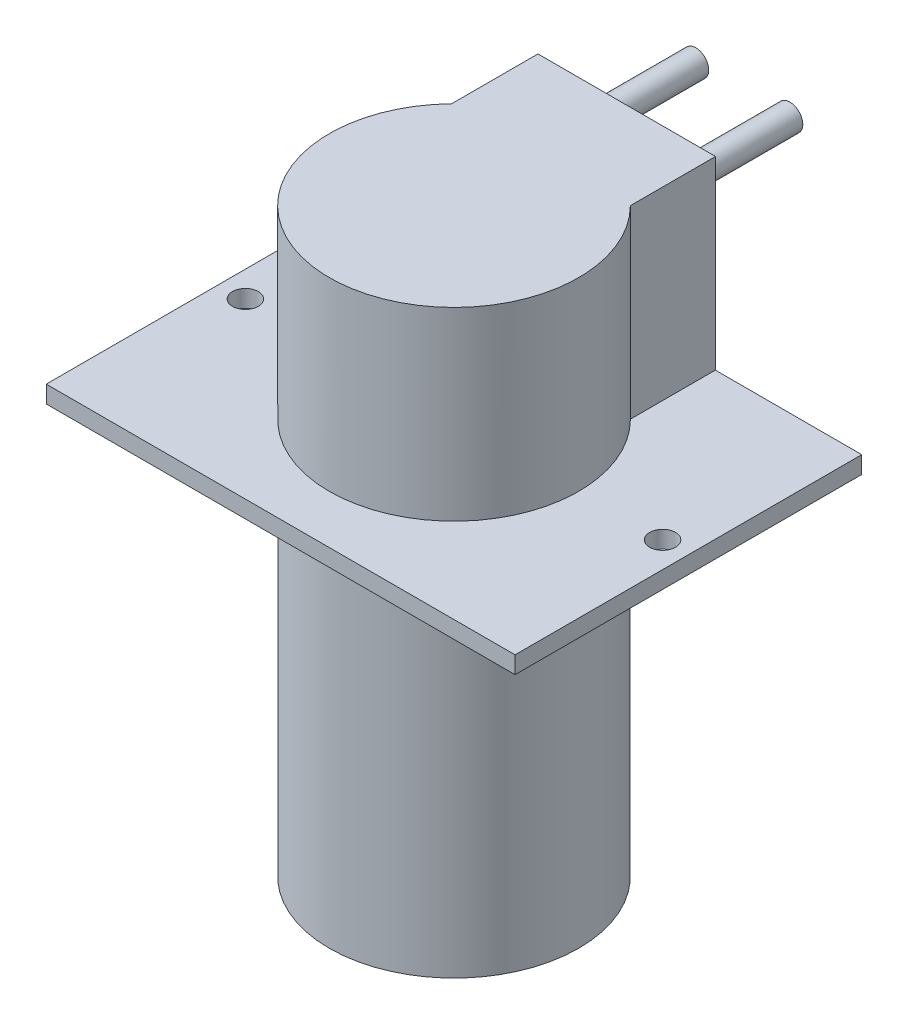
ISO-10303-21;
HEADER;
FILE_DESCRIPTION(('STEP AP214'),'2;1');
FILE_NAME('part.step','',(''),(''),'','','');
FILE_SCHEMA(('AUTOMOTIVE_DESIGN { 1 0 10303 214 1 1 1 1 }'));
ENDSEC;
DATA;
#1=APPLICATION_CONTEXT('core data for automotive mechanical design processes');
#2=APPLICATION_PROTOCOL_DEFINITION('international standard','automotive_design',2000,#1);
#3=PRODUCT_CONTEXT('',#1,'mechanical');
#4=PRODUCT('Part','Part','',(#3));
#5=PRODUCT_RELATED_PRODUCT_CATEGORY('part','',(#4));
#6=PRODUCT_DEFINITION_FORMATION('','',#4);
#7=PRODUCT_DEFINITION_CONTEXT('part definition',#1,'design');
#8=PRODUCT_DEFINITION('design','',#6,#7);
#9=PRODUCT_DEFINITION_SHAPE('','',#8);
#10=(LENGTH_UNIT() NAMED_UNIT(*) SI_UNIT(.MILLI.,.METRE.));
#11=(NAMED_UNIT(*) PLANE_ANGLE_UNIT() SI_UNIT($,.RADIAN.));
#12=(NAMED_UNIT(*) SI_UNIT($,.STERADIAN.) SOLID_ANGLE_UNIT());
#13=UNCERTAINTY_MEASURE_WITH_UNIT(LENGTH_MEASURE(1.E-05),#10,'distance_accuracy_value','');
#14=(GEOMETRIC_REPRESENTATION_CONTEXT(3) GLOBAL_UNCERTAINTY_ASSIGNED_CONTEXT((#13)) GLOBAL_UNIT_ASSIGNED_CONTEXT((#10,
#11,#12)) REPRESENTATION_CONTEXT('',''));
#15=CARTESIAN_POINT('',(0.,0.,0.));
#16=DIRECTION('',(0.,0.,1.));
#17=DIRECTION('',(1.,0.,0.));
#18=AXIS2_PLACEMENT_3D('',#15,#16,#17);
#19=CARTESIAN_POINT('',(0.,44.,0.));
#20=DIRECTION('',(0.,-1.,0.));
#21=DIRECTION('',(0.,0.,-1.));
#22=AXIS2_PLACEMENT_3D('',#19,#20,#21);
#23=CYLINDRICAL_SURFACE('',#22,14.5);
#24=CARTESIAN_POINT('',(0.,44.,0.));
#25=DIRECTION('',(0.,1.,0.));
#26=DIRECTION('',(0.,0.,1.));
#27=AXIS2_PLACEMENT_3D('',#24,#25,#26);
#28=CIRCLE('',#27,14.5);
#29=CARTESIAN_POINT('',(0.,44.,14.5));
#30=VERTEX_POINT('',#29);
#31=EDGE_CURVE('E158',#30,#30,#28,.T.);
#32=ORIENTED_EDGE('',*,*,#31,.F.);
#33=EDGE_LOOP('',(#32));
#34=FACE_BOUND('',#33,.T.);
#35=CARTESIAN_POINT('',(0.,0.,0.));
#36=DIRECTION('',(0.,1.,0.));
#37=DIRECTION('',(0.,0.,1.));
#38=AXIS2_PLACEMENT_3D('',#35,#36,#37);
#39=CIRCLE('',#38,14.5);
#40=CARTESIAN_POINT('',(0.,0.,14.5));
#41=VERTEX_POINT('',#40);
#42=EDGE_CURVE('E181',#41,#41,#39,.T.);
#43=ORIENTED_EDGE('',*,*,#42,.T.);
#44=EDGE_LOOP('',(#43));
#45=FACE_BOUND('',#44,.T.);
#46=ADVANCED_FACE('F41',(#34,#45),#23,.T.);
#47=CARTESIAN_POINT('',(0.,0.,0.));
#48=DIRECTION('',(0.,1.,0.));
#49=DIRECTION('',(0.,0.,1.));
#50=AXIS2_PLACEMENT_3D('',#47,#48,#49);
#51=PLANE('',#50);
#52=ORIENTED_EDGE('',*,*,#42,.F.);
#53=EDGE_LOOP('',(#52));
#54=FACE_BOUND('',#53,.T.);
#55=ADVANCED_FACE('F221',(#54),#51,.F.);
#56=CARTESIAN_POINT('',(27.25,46.,20.15));
#57=DIRECTION('',(-1.,0.,0.));
#58=DIRECTION('',(0.,0.,1.));
#59=AXIS2_PLACEMENT_3D('',#56,#57,#58);
#60=PLANE('',#59);
#61=DIRECTION('',(0.,0.,-1.));
#62=VECTOR('',#61,1.);
#63=CARTESIAN_POINT('',(27.25,44.,20.15));
#64=LINE('',#63,#62);
#65=CARTESIAN_POINT('',(27.25,44.,20.15));
#66=VERTEX_POINT('',#65);
#67=CARTESIAN_POINT('',(27.25,44.,-20.15));
#68=VERTEX_POINT('',#67);
#69=EDGE_CURVE('E154',#66,#68,#64,.T.);
#70=ORIENTED_EDGE('',*,*,#69,.T.);
#71=DIRECTION('',(0.,-1.,0.));
#72=VECTOR('',#71,1.);
#73=CARTESIAN_POINT('',(27.25,46.,-20.15));
#74=LINE('',#73,#72);
#75=CARTESIAN_POINT('',(27.25,46.,-20.15));
#76=VERTEX_POINT('',#75);
#77=EDGE_CURVE('E179',#76,#68,#74,.T.);
#78=ORIENTED_EDGE('',*,*,#77,.F.);
#79=DIRECTION('',(0.,0.,-1.));
#80=VECTOR('',#79,1.);
#81=CARTESIAN_POINT('',(27.25,46.,20.15));
#82=LINE('',#81,#80);
#83=CARTESIAN_POINT('',(27.25,46.,20.15));
#84=VERTEX_POINT('',#83);
#85=EDGE_CURVE('E159',#84,#76,#82,.T.);
#86=ORIENTED_EDGE('',*,*,#85,.F.);
#87=DIRECTION('',(0.,-1.,0.));
#88=VECTOR('',#87,1.);
#89=CARTESIAN_POINT('',(27.25,46.,20.15));
#90=LINE('',#89,#88);
#91=EDGE_CURVE('E165',#84,#66,#90,.T.);
#92=ORIENTED_EDGE('',*,*,#91,.T.);
#93=EDGE_LOOP('',(#70,#78,#86,#92));
#94=FACE_BOUND('',#93,.T.);
#95=ADVANCED_FACE('F206',(#94),#60,.F.);
#96=CARTESIAN_POINT('',(-27.25,46.,-20.15));
#97=DIRECTION('',(0.,0.,1.));
#98=DIRECTION('',(1.,0.,0.));
#99=AXIS2_PLACEMENT_3D('',#96,#97,#98);
#100=PLANE('',#99);
#101=DIRECTION('',(-1.,0.,0.));
#102=VECTOR('',#101,1.);
#103=CARTESIAN_POINT('',(-27.25,44.,-20.15));
#104=LINE('',#103,#102);
#105=CARTESIAN_POINT('',(-27.25,44.,-20.15));
#106=VERTEX_POINT('',#105);
#107=EDGE_CURVE('E168',#68,#106,#104,.T.);
#108=ORIENTED_EDGE('',*,*,#107,.T.);
#109=DIRECTION('',(0.,-1.,0.));
#110=VECTOR('',#109,1.);
#111=CARTESIAN_POINT('',(-27.25,46.,-20.15));
#112=LINE('',#111,#110);
#113=CARTESIAN_POINT('',(-27.25,46.,-20.15));
#114=VERTEX_POINT('',#113);
#115=EDGE_CURVE('E176',#114,#106,#112,.T.);
#116=ORIENTED_EDGE('',*,*,#115,.F.);
#117=DIRECTION('',(-1.,0.,0.));
#118=VECTOR('',#117,1.);
#119=CARTESIAN_POINT('',(-27.25,46.,-20.15));
#120=LINE('',#119,#118);
#121=EDGE_CURVE('E93',#76,#114,#120,.T.);
#122=ORIENTED_EDGE('',*,*,#121,.F.);
#123=ORIENTED_EDGE('',*,*,#77,.T.);
#124=EDGE_LOOP('',(#108,#116,#122,#123));
#125=FACE_BOUND('',#124,.T.);
#126=ADVANCED_FACE('F213',(#125),#100,.F.);
#127=CARTESIAN_POINT('',(-27.25,46.,20.15));
#128=DIRECTION('',(1.,0.,0.));
#129=DIRECTION('',(0.,0.,-1.));
#130=AXIS2_PLACEMENT_3D('',#127,#128,#129);
#131=PLANE('',#130);
#132=DIRECTION('',(0.,0.,1.));
#133=VECTOR('',#132,1.);
#134=CARTESIAN_POINT('',(-27.25,44.,20.15));
#135=LINE('',#134,#133);
#136=CARTESIAN_POINT('',(-27.25,44.,20.15));
#137=VERTEX_POINT('',#136);
#138=EDGE_CURVE('E170',#106,#137,#135,.T.);
#139=ORIENTED_EDGE('',*,*,#138,.T.);
#140=DIRECTION('',(0.,-1.,0.));
#141=VECTOR('',#140,1.);
#142=CARTESIAN_POINT('',(-27.25,46.,20.15));
#143=LINE('',#142,#141);
#144=CARTESIAN_POINT('',(-27.25,46.,20.15));
#145=VERTEX_POINT('',#144);
#146=EDGE_CURVE('E174',#145,#137,#143,.T.);
#147=ORIENTED_EDGE('',*,*,#146,.F.);
#148=DIRECTION('',(0.,0.,1.));
#149=VECTOR('',#148,1.);
#150=CARTESIAN_POINT('',(-27.25,46.,20.15));
#151=LINE('',#150,#149);
#152=EDGE_CURVE('E162',#114,#145,#151,.T.);
#153=ORIENTED_EDGE('',*,*,#152,.F.);
#154=ORIENTED_EDGE('',*,*,#115,.T.);
#155=EDGE_LOOP('',(#139,#147,#153,#154));
#156=FACE_BOUND('',#155,.T.);
#157=ADVANCED_FACE('F212',(#156),#131,.F.);
#158=CARTESIAN_POINT('',(-27.25,46.,20.15));
#159=DIRECTION('',(0.,0.,-1.));
#160=DIRECTION('',(-1.,0.,0.));
#161=AXIS2_PLACEMENT_3D('',#158,#159,#160);
#162=PLANE('',#161);
#163=DIRECTION('',(1.,0.,0.));
#164=VECTOR('',#163,1.);
#165=CARTESIAN_POINT('',(-27.25,44.,20.15));
#166=LINE('',#165,#164);
#167=EDGE_CURVE('E85',#137,#66,#166,.T.);
#168=ORIENTED_EDGE('',*,*,#167,.T.);
#169=ORIENTED_EDGE('',*,*,#91,.F.);
#170=DIRECTION('',(1.,0.,0.));
#171=VECTOR('',#170,1.);
#172=CARTESIAN_POINT('',(-27.25,46.,20.15));
#173=LINE('',#172,#171);
#174=EDGE_CURVE('E64',#145,#84,#173,.T.);
#175=ORIENTED_EDGE('',*,*,#174,.F.);
#176=ORIENTED_EDGE('',*,*,#146,.T.);
#177=EDGE_LOOP('',(#168,#169,#175,#176));
#178=FACE_BOUND('',#177,.T.);
#179=ADVANCED_FACE('F208',(#178),#162,.F.);
#180=CARTESIAN_POINT('',(0.,46.,0.));
#181=DIRECTION('',(0.,-1.,0.));
#182=DIRECTION('',(0.,0.,-1.));
#183=AXIS2_PLACEMENT_3D('',#180,#181,#182);
#184=PLANE('',#183);
#185=CARTESIAN_POINT('',(-24.25,46.,0.));
#186=DIRECTION('',(0.,1.,0.));
#187=DIRECTION('',(0.,0.,1.));
#188=AXIS2_PLACEMENT_3D('',#185,#186,#187);
#189=CIRCLE('',#188,1.5);
#190=CARTESIAN_POINT('',(-24.25,46.,1.5));
#191=VERTEX_POINT('',#190);
#192=EDGE_CURVE('E147',#191,#191,#189,.T.);
#193=ORIENTED_EDGE('',*,*,#192,.F.);
#194=EDGE_LOOP('',(#193));
#195=FACE_BOUND('',#194,.T.);
#196=CARTESIAN_POINT('',(24.25,46.,0.));
#197=DIRECTION('',(0.,1.,0.));
#198=DIRECTION('',(0.,0.,1.));
#199=AXIS2_PLACEMENT_3D('',#196,#197,#198);
#200=CIRCLE('',#199,1.5);
#201=CARTESIAN_POINT('',(24.25,46.,1.5));
#202=VERTEX_POINT('',#201);
#203=EDGE_CURVE('E146',#202,#202,#200,.T.);
#204=ORIENTED_EDGE('',*,*,#203,.F.);
#205=EDGE_LOOP('',(#204));
#206=FACE_BOUND('',#205,.T.);
#207=CARTESIAN_POINT('',(0.,46.,0.));
#208=DIRECTION('',(0.,1.,0.));
#209=DIRECTION('',(0.,0.,1.));
#210=AXIS2_PLACEMENT_3D('',#207,#208,#209);
#211=CIRCLE('',#210,14.5);
#212=CARTESIAN_POINT('',(0.,46.,14.5));
#213=VERTEX_POINT('',#212);
#214=EDGE_CURVE('E48',#213,#213,#211,.T.);
#215=ORIENTED_EDGE('',*,*,#214,.F.);
#216=EDGE_LOOP('',(#215));
#217=FACE_BOUND('',#216,.T.);
#218=ORIENTED_EDGE('',*,*,#85,.T.);
#219=ORIENTED_EDGE('',*,*,#121,.T.);
#220=ORIENTED_EDGE('',*,*,#152,.T.);
#221=ORIENTED_EDGE('',*,*,#174,.T.);
#222=EDGE_LOOP('',(#218,#219,#220,#221));
#223=FACE_BOUND('',#222,.T.);
#224=ADVANCED_FACE('F196',(#195,#206,#217,#223),#184,.F.);
#225=CARTESIAN_POINT('',(0.,44.,0.));
#226=DIRECTION('',(0.,-1.,0.));
#227=DIRECTION('',(0.,0.,-1.));
#228=AXIS2_PLACEMENT_3D('',#225,#226,#227);
#229=PLANE('',#228);
#230=CARTESIAN_POINT('',(-24.25,44.,0.));
#231=DIRECTION('',(0.,-1.,0.));
#232=DIRECTION('',(0.,0.,-1.));
#233=AXIS2_PLACEMENT_3D('',#230,#231,#232);
#234=CIRCLE('',#233,1.5);
#235=CARTESIAN_POINT('',(-24.25,44.,-1.5));
#236=VERTEX_POINT('',#235);
#237=EDGE_CURVE('E155',#236,#236,#234,.T.);
#238=ORIENTED_EDGE('',*,*,#237,.F.);
#239=EDGE_LOOP('',(#238));
#240=FACE_BOUND('',#239,.T.);
#241=CARTESIAN_POINT('',(24.25,44.,0.));
#242=DIRECTION('',(0.,-1.,0.));
#243=DIRECTION('',(0.,0.,-1.));
#244=AXIS2_PLACEMENT_3D('',#241,#242,#243);
#245=CIRCLE('',#244,1.5);
#246=CARTESIAN_POINT('',(24.25,44.,-1.5));
#247=VERTEX_POINT('',#246);
#248=EDGE_CURVE('E150',#247,#247,#245,.T.);
#249=ORIENTED_EDGE('',*,*,#248,.F.);
#250=EDGE_LOOP('',(#249));
#251=FACE_BOUND('',#250,.T.);
#252=ORIENTED_EDGE('',*,*,#31,.T.);
#253=EDGE_LOOP('',(#252));
#254=FACE_BOUND('',#253,.T.);
#255=ORIENTED_EDGE('',*,*,#69,.F.);
#256=ORIENTED_EDGE('',*,*,#167,.F.);
#257=ORIENTED_EDGE('',*,*,#138,.F.);
#258=ORIENTED_EDGE('',*,*,#107,.F.);
#259=EDGE_LOOP('',(#255,#256,#257,#258));
#260=FACE_BOUND('',#259,.T.);
#261=ADVANCED_FACE('F193',(#240,#251,#254,#260),#229,.T.);
#262=CARTESIAN_POINT('',(0.,67.5225260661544,0.));
#263=DIRECTION('',(0.,-1.,0.));
#264=DIRECTION('',(0.,0.,-1.));
#265=AXIS2_PLACEMENT_3D('',#262,#263,#264);
#266=CYLINDRICAL_SURFACE('',#265,14.5);
#267=CARTESIAN_POINT('',(0.,46.0225260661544,0.));
#268=DIRECTION('',(0.,-1.,0.));
#269=DIRECTION('',(0.,0.,-1.));
#270=AXIS2_PLACEMENT_3D('',#267,#268,#269);
#271=CIRCLE('',#270,14.5);
#272=CARTESIAN_POINT('',(-10.3925259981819,46.0225260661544,-10.1116469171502));
#273=VERTEX_POINT('',#272);
#274=CARTESIAN_POINT('',(10.2544936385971,46.0225260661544,-10.251602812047));
#275=VERTEX_POINT('',#274);
#276=EDGE_CURVE('E11',#273,#275,#271,.T.);
#277=ORIENTED_EDGE('',*,*,#276,.T.);
#278=DIRECTION('',(0.,-1.,0.));
#279=VECTOR('',#278,1.);
#280=CARTESIAN_POINT('',(10.2544936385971,67.5225260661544,-10.251602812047));
#281=LINE('',#280,#279);
#282=CARTESIAN_POINT('',(10.2544936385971,67.5225260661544,-10.251602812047));
#283=VERTEX_POINT('',#282);
#284=EDGE_CURVE('E144',#275,#283,#281,.F.);
#285=ORIENTED_EDGE('',*,*,#284,.T.);
#286=CARTESIAN_POINT('',(0.,67.5225260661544,0.));
#287=DIRECTION('',(0.,1.,0.));
#288=DIRECTION('',(0.,0.,1.));
#289=AXIS2_PLACEMENT_3D('',#286,#287,#288);
#290=CIRCLE('',#289,14.5);
#291=CARTESIAN_POINT('',(-10.3925259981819,67.5225260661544,-10.1116469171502));
#292=VERTEX_POINT('',#291);
#293=EDGE_CURVE('E135',#292,#283,#290,.T.);
#294=ORIENTED_EDGE('',*,*,#293,.F.);
#295=DIRECTION('',(0.,1.,0.));
#296=VECTOR('',#295,1.);
#297=CARTESIAN_POINT('',(-10.3925259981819,46.0225260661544,-10.1116469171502));
#298=LINE('',#297,#296);
#299=EDGE_CURVE('E128',#273,#292,#298,.T.);
#300=ORIENTED_EDGE('',*,*,#299,.F.);
#301=EDGE_LOOP('',(#277,#285,#294,#300));
#302=FACE_BOUND('',#301,.T.);
#303=ORIENTED_EDGE('',*,*,#214,.T.);
#304=EDGE_LOOP('',(#303));
#305=FACE_BOUND('',#304,.T.);
#306=ADVANCED_FACE('F133',(#302,#305),#266,.T.);
#307=CARTESIAN_POINT('',(0.,67.5225260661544,0.));
#308=DIRECTION('',(0.,1.,0.));
#309=DIRECTION('',(0.,0.,1.));
#310=AXIS2_PLACEMENT_3D('',#307,#308,#309);
#311=PLANE('',#310);
#312=ORIENTED_EDGE('',*,*,#293,.T.);
#313=DIRECTION('',(0.,0.,-1.));
#314=VECTOR('',#313,1.);
#315=CARTESIAN_POINT('',(10.2544936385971,67.5225260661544,-10.1116469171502));
#316=LINE('',#315,#314);
#317=CARTESIAN_POINT('',(10.2544936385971,67.5225260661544,-20.15));
#318=VERTEX_POINT('',#317);
#319=EDGE_CURVE('E394',#283,#318,#316,.T.);
#320=ORIENTED_EDGE('',*,*,#319,.T.);
#321=DIRECTION('',(-1.,0.,0.));
#322=VECTOR('',#321,1.);
#323=CARTESIAN_POINT('',(-10.3925259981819,67.5225260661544,-20.15));
#324=LINE('',#323,#322);
#325=CARTESIAN_POINT('',(-10.3925259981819,67.5225260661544,-20.15));
#326=VERTEX_POINT('',#325);
#327=EDGE_CURVE('E131',#318,#326,#324,.T.);
#328=ORIENTED_EDGE('',*,*,#327,.T.);
#329=DIRECTION('',(0.,0.,1.));
#330=VECTOR('',#329,1.);
#331=CARTESIAN_POINT('',(-10.3925259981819,67.5225260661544,-10.1116469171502));
#332=LINE('',#331,#330);
#333=EDGE_CURVE('E55',#326,#292,#332,.T.);
#334=ORIENTED_EDGE('',*,*,#333,.T.);
#335=EDGE_LOOP('',(#312,#320,#328,#334));
#336=FACE_BOUND('',#335,.T.);
#337=ADVANCED_FACE('F282',(#336),#311,.T.);
#338=CARTESIAN_POINT('',(24.25,22.5,0.));
#339=DIRECTION('',(0.,1.,0.));
#340=DIRECTION('',(0.,0.,1.));
#341=AXIS2_PLACEMENT_3D('',#338,#339,#340);
#342=CYLINDRICAL_SURFACE('',#341,1.5);
#343=ORIENTED_EDGE('',*,*,#248,.T.);
#344=EDGE_LOOP('',(#343));
#345=FACE_BOUND('',#344,.T.);
#346=ORIENTED_EDGE('',*,*,#203,.T.);
#347=EDGE_LOOP('',(#346));
#348=FACE_BOUND('',#347,.T.);
#349=ADVANCED_FACE('F293',(#345,#348),#342,.F.);
#350=CARTESIAN_POINT('',(-24.25,22.5,0.));
#351=DIRECTION('',(0.,1.,0.));
#352=DIRECTION('',(0.,0.,1.));
#353=AXIS2_PLACEMENT_3D('',#350,#351,#352);
#354=CYLINDRICAL_SURFACE('',#353,1.5);
#355=ORIENTED_EDGE('',*,*,#237,.T.);
#356=EDGE_LOOP('',(#355));
#357=FACE_BOUND('',#356,.T.);
#358=ORIENTED_EDGE('',*,*,#192,.T.);
#359=EDGE_LOOP('',(#358));
#360=FACE_BOUND('',#359,.T.);
#361=ADVANCED_FACE('F190',(#357,#360),#354,.F.);
#362=CARTESIAN_POINT('',(10.2544936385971,46.0225260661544,-10.1116469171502));
#363=DIRECTION('',(1.,0.,0.));
#364=DIRECTION('',(0.,0.,-1.));
#365=AXIS2_PLACEMENT_3D('',#362,#363,#364);
#366=PLANE('',#365);
#367=ORIENTED_EDGE('',*,*,#284,.F.);
#368=DIRECTION('',(0.,0.,-1.));
#369=VECTOR('',#368,1.);
#370=CARTESIAN_POINT('',(10.2544936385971,46.0225260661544,-10.1116469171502));
#371=LINE('',#370,#369);
#372=CARTESIAN_POINT('',(10.2544936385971,46.0225260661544,-20.15));
#373=VERTEX_POINT('',#372);
#374=EDGE_CURVE('E122',#275,#373,#371,.T.);
#375=ORIENTED_EDGE('',*,*,#374,.T.);
#376=DIRECTION('',(0.,1.,0.));
#377=VECTOR('',#376,1.);
#378=CARTESIAN_POINT('',(10.2544936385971,46.0225260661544,-20.15));
#379=LINE('',#378,#377);
#380=EDGE_CURVE('E136',#373,#318,#379,.T.);
#381=ORIENTED_EDGE('',*,*,#380,.T.);
#382=ORIENTED_EDGE('',*,*,#319,.F.);
#383=EDGE_LOOP('',(#367,#375,#381,#382));
#384=FACE_BOUND('',#383,.T.);
#385=ADVANCED_FACE('F310',(#384),#366,.T.);
#386=CARTESIAN_POINT('',(-10.3925259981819,46.0225260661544,-10.1116469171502));
#387=DIRECTION('',(-1.,0.,0.));
#388=DIRECTION('',(0.,0.,1.));
#389=AXIS2_PLACEMENT_3D('',#386,#387,#388);
#390=PLANE('',#389);
#391=ORIENTED_EDGE('',*,*,#333,.F.);
#392=DIRECTION('',(0.,1.,0.));
#393=VECTOR('',#392,1.);
#394=CARTESIAN_POINT('',(-10.3925259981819,46.0225260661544,-20.15));
#395=LINE('',#394,#393);
#396=CARTESIAN_POINT('',(-10.3925259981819,46.0225260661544,-20.15));
#397=VERTEX_POINT('',#396);
#398=EDGE_CURVE('E130',#397,#326,#395,.T.);
#399=ORIENTED_EDGE('',*,*,#398,.F.);
#400=DIRECTION('',(0.,0.,1.));
#401=VECTOR('',#400,1.);
#402=CARTESIAN_POINT('',(-10.3925259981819,46.0225260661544,-10.1116469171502));
#403=LINE('',#402,#401);
#404=EDGE_CURVE('E120',#397,#273,#403,.T.);
#405=ORIENTED_EDGE('',*,*,#404,.T.);
#406=ORIENTED_EDGE('',*,*,#299,.T.);
#407=EDGE_LOOP('',(#391,#399,#405,#406));
#408=FACE_BOUND('',#407,.T.);
#409=ADVANCED_FACE('F127',(#408),#390,.T.);
#410=CARTESIAN_POINT('',(-10.3925259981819,46.0225260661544,-20.15));
#411=DIRECTION('',(0.,0.,-1.));
#412=DIRECTION('',(-1.,0.,0.));
#413=AXIS2_PLACEMENT_3D('',#410,#411,#412);
#414=PLANE('',#413);
#415=CARTESIAN_POINT('',(5.39713194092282,62.3214031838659,-20.15));
#416=DIRECTION('',(0.,0.,-1.));
#417=DIRECTION('',(-1.,0.,0.));
#418=AXIS2_PLACEMENT_3D('',#415,#416,#417);
#419=CIRCLE('',#418,1.5);
#420=CARTESIAN_POINT('',(3.89713194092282,62.3214031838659,-20.15));
#421=VERTEX_POINT('',#420);
#422=EDGE_CURVE('E392',#421,#421,#419,.T.);
#423=ORIENTED_EDGE('',*,*,#422,.F.);
#424=EDGE_LOOP('',(#423));
#425=FACE_BOUND('',#424,.T.);
#426=CARTESIAN_POINT('',(-5.53551993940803,62.3214031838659,-20.15));
#427=DIRECTION('',(0.,0.,-1.));
#428=DIRECTION('',(-1.,0.,0.));
#429=AXIS2_PLACEMENT_3D('',#426,#427,#428);
#430=CIRCLE('',#429,1.5);
#431=CARTESIAN_POINT('',(-7.03551993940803,62.3214031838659,-20.15));
#432=VERTEX_POINT('',#431);
#433=EDGE_CURVE('E397',#432,#432,#430,.T.);
#434=ORIENTED_EDGE('',*,*,#433,.F.);
#435=EDGE_LOOP('',(#434));
#436=FACE_BOUND('',#435,.T.);
#437=ORIENTED_EDGE('',*,*,#327,.F.);
#438=ORIENTED_EDGE('',*,*,#380,.F.);
#439=DIRECTION('',(-1.,0.,0.));
#440=VECTOR('',#439,1.);
#441=CARTESIAN_POINT('',(-10.3925259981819,46.0225260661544,-20.15));
#442=LINE('',#441,#440);
#443=EDGE_CURVE('E137',#373,#397,#442,.T.);
#444=ORIENTED_EDGE('',*,*,#443,.T.);
#445=ORIENTED_EDGE('',*,*,#398,.T.);
#446=EDGE_LOOP('',(#437,#438,#444,#445));
#447=FACE_BOUND('',#446,.T.);
#448=ADVANCED_FACE('F326',(#425,#436,#447),#414,.T.);
#449=CARTESIAN_POINT('',(0.,46.0225260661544,0.));
#450=DIRECTION('',(0.,-1.,0.));
#451=DIRECTION('',(0.,0.,-1.));
#452=AXIS2_PLACEMENT_3D('',#449,#450,#451);
#453=PLANE('',#452);
#454=ORIENTED_EDGE('',*,*,#276,.F.);
#455=ORIENTED_EDGE('',*,*,#404,.F.);
#456=ORIENTED_EDGE('',*,*,#443,.F.);
#457=ORIENTED_EDGE('',*,*,#374,.F.);
#458=EDGE_LOOP('',(#454,#455,#456,#457));
#459=FACE_BOUND('',#458,.T.);
#460=ADVANCED_FACE('F118',(#459),#453,.T.);
#461=CARTESIAN_POINT('',(-5.53551993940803,62.3214031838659,-33.65));
#462=DIRECTION('',(0.,0.,1.));
#463=DIRECTION('',(1.,0.,0.));
#464=AXIS2_PLACEMENT_3D('',#461,#462,#463);
#465=CYLINDRICAL_SURFACE('',#464,1.5);
#466=CARTESIAN_POINT('',(-5.53551993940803,62.3214031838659,-33.65));
#467=DIRECTION('',(0.,0.,-1.));
#468=DIRECTION('',(-1.,0.,0.));
#469=AXIS2_PLACEMENT_3D('',#466,#467,#468);
#470=CIRCLE('',#469,1.5);
#471=CARTESIAN_POINT('',(-7.03551993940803,62.3214031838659,-33.65));
#472=VERTEX_POINT('',#471);
#473=EDGE_CURVE('E402',#472,#472,#470,.T.);
#474=ORIENTED_EDGE('',*,*,#473,.F.);
#475=EDGE_LOOP('',(#474));
#476=FACE_BOUND('',#475,.T.);
#477=ORIENTED_EDGE('',*,*,#433,.T.);
#478=EDGE_LOOP('',(#477));
#479=FACE_BOUND('',#478,.T.);
#480=ADVANCED_FACE('F342',(#476,#479),#465,.T.);
#481=CARTESIAN_POINT('',(-5.53551993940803,62.3214031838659,-33.65));
#482=DIRECTION('',(0.,0.,-1.));
#483=DIRECTION('',(-1.,0.,0.));
#484=AXIS2_PLACEMENT_3D('',#481,#482,#483);
#485=PLANE('',#484);
#486=ORIENTED_EDGE('',*,*,#473,.T.);
#487=EDGE_LOOP('',(#486));
#488=FACE_BOUND('',#487,.T.);
#489=ADVANCED_FACE('F350',(#488),#485,.T.);
#490=CARTESIAN_POINT('',(5.39713194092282,62.3214031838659,-33.65));
#491=DIRECTION('',(0.,0.,1.));
#492=DIRECTION('',(1.,0.,0.));
#493=AXIS2_PLACEMENT_3D('',#490,#491,#492);
#494=CYLINDRICAL_SURFACE('',#493,1.5);
#495=CARTESIAN_POINT('',(5.39713194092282,62.3214031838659,-33.65));
#496=DIRECTION('',(0.,0.,-1.));
#497=DIRECTION('',(-1.,0.,0.));
#498=AXIS2_PLACEMENT_3D('',#495,#496,#497);
#499=CIRCLE('',#498,1.5);
#500=CARTESIAN_POINT('',(3.89713194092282,62.3214031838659,-33.65));
#501=VERTEX_POINT('',#500);
#502=EDGE_CURVE('E391',#501,#501,#499,.T.);
#503=ORIENTED_EDGE('',*,*,#502,.F.);
#504=EDGE_LOOP('',(#503));
#505=FACE_BOUND('',#504,.T.);
#506=ORIENTED_EDGE('',*,*,#422,.T.);
#507=EDGE_LOOP('',(#506));
#508=FACE_BOUND('',#507,.T.);
#509=ADVANCED_FACE('F359',(#505,#508),#494,.T.);
#510=CARTESIAN_POINT('',(5.39713194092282,62.3214031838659,-33.65));
#511=DIRECTION('',(0.,0.,-1.));
#512=DIRECTION('',(-1.,0.,0.));
#513=AXIS2_PLACEMENT_3D('',#510,#511,#512);
#514=PLANE('',#513);
#515=ORIENTED_EDGE('',*,*,#502,.T.);
#516=EDGE_LOOP('',(#515));
#517=FACE_BOUND('',#516,.T.);
#518=ADVANCED_FACE('F368',(#517),#514,.T.);
#519=CLOSED_SHELL('',(#46,#55,#95,#126,#157,#179,#224,#261,#306,#337,#349,#361,#385,#409,#448,
#460,#480,#489,#509,#518));
#520=MANIFOLD_SOLID_BREP('B2',#519);
#521=ADVANCED_BREP_SHAPE_REPRESENTATION('',(#18,#520),#14);
#522=SHAPE_DEFINITION_REPRESENTATION(#9,#521);
ENDSEC;
END-ISO-10303-21;
